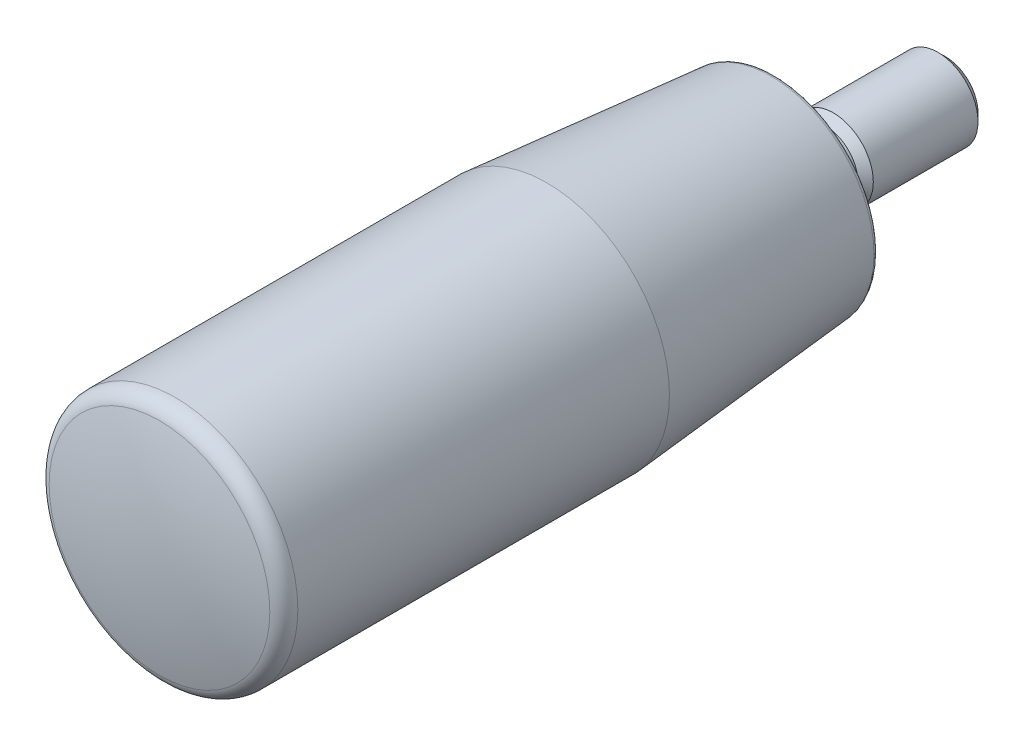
ISO-10303-21;
HEADER;
FILE_DESCRIPTION(('STEP AP214'),'2;1');
FILE_NAME('part.step','',(''),(''),'','','');
FILE_SCHEMA(('AUTOMOTIVE_DESIGN { 1 0 10303 214 1 1 1 1 }'));
ENDSEC;
DATA;
#1=APPLICATION_CONTEXT('core data for automotive mechanical design processes');
#2=APPLICATION_PROTOCOL_DEFINITION('international standard','automotive_design',2000,#1);
#3=PRODUCT_CONTEXT('',#1,'mechanical');
#4=PRODUCT('Part','Part','',(#3));
#5=PRODUCT_RELATED_PRODUCT_CATEGORY('part','',(#4));
#6=PRODUCT_DEFINITION_FORMATION('','',#4);
#7=PRODUCT_DEFINITION_CONTEXT('part definition',#1,'design');
#8=PRODUCT_DEFINITION('design','',#6,#7);
#9=PRODUCT_DEFINITION_SHAPE('','',#8);
#10=(LENGTH_UNIT() NAMED_UNIT(*) SI_UNIT(.MILLI.,.METRE.));
#11=(NAMED_UNIT(*) PLANE_ANGLE_UNIT() SI_UNIT($,.RADIAN.));
#12=(NAMED_UNIT(*) SI_UNIT($,.STERADIAN.) SOLID_ANGLE_UNIT());
#13=UNCERTAINTY_MEASURE_WITH_UNIT(LENGTH_MEASURE(1.E-05),#10,'distance_accuracy_value','');
#14=(GEOMETRIC_REPRESENTATION_CONTEXT(3) GLOBAL_UNCERTAINTY_ASSIGNED_CONTEXT((#13)) GLOBAL_UNIT_ASSIGNED_CONTEXT((#10,
#11,#12)) REPRESENTATION_CONTEXT('',''));
#15=CARTESIAN_POINT('',(0.,0.,0.));
#16=DIRECTION('',(0.,0.,1.));
#17=DIRECTION('',(1.,0.,0.));
#18=AXIS2_PLACEMENT_3D('',#15,#16,#17);
#19=CARTESIAN_POINT('',(0.,0.,-15.));
#20=DIRECTION('',(0.,0.,1.));
#21=DIRECTION('',(1.,0.,0.));
#22=AXIS2_PLACEMENT_3D('',#19,#20,#21);
#23=PLANE('',#22);
#24=CARTESIAN_POINT('',(0.,0.,-15.));
#25=DIRECTION('',(0.,0.,1.));
#26=DIRECTION('',(1.,0.,0.));
#27=AXIS2_PLACEMENT_3D('',#24,#25,#26);
#28=CIRCLE('',#27,3.233);
#29=CARTESIAN_POINT('',(3.233,0.,-15.));
#30=VERTEX_POINT('',#29);
#31=EDGE_CURVE('E130',#30,#30,#28,.T.);
#32=ORIENTED_EDGE('',*,*,#31,.F.);
#33=EDGE_LOOP('',(#32));
#34=FACE_BOUND('',#33,.T.);
#35=DIRECTION('',(-0.866025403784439,-0.5,0.));
#36=VECTOR('',#35,1.);
#37=CARTESIAN_POINT('',(1.,-1.73205080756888,-15.));
#38=LINE('',#37,#36);
#39=CARTESIAN_POINT('',(2.,-1.15470053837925,-15.));
#40=VERTEX_POINT('',#39);
#41=CARTESIAN_POINT('',(0.,-2.30940107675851,-15.));
#42=VERTEX_POINT('',#41);
#43=EDGE_CURVE('E9',#40,#42,#38,.T.);
#44=ORIENTED_EDGE('',*,*,#43,.F.);
#45=DIRECTION('',(0.,-1.,0.));
#46=VECTOR('',#45,1.);
#47=CARTESIAN_POINT('',(2.,0.,-15.));
#48=LINE('',#47,#46);
#49=CARTESIAN_POINT('',(2.,1.15470053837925,-15.));
#50=VERTEX_POINT('',#49);
#51=EDGE_CURVE('E78',#50,#40,#48,.T.);
#52=ORIENTED_EDGE('',*,*,#51,.F.);
#53=DIRECTION('',(0.866025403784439,-0.5,0.));
#54=VECTOR('',#53,1.);
#55=CARTESIAN_POINT('',(1.,1.73205080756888,-15.));
#56=LINE('',#55,#54);
#57=CARTESIAN_POINT('',(0.,2.30940107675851,-15.));
#58=VERTEX_POINT('',#57);
#59=EDGE_CURVE('E134',#58,#50,#56,.T.);
#60=ORIENTED_EDGE('',*,*,#59,.F.);
#61=DIRECTION('',(0.866025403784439,0.5,0.));
#62=VECTOR('',#61,1.);
#63=CARTESIAN_POINT('',(-1.,1.73205080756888,-15.));
#64=LINE('',#63,#62);
#65=CARTESIAN_POINT('',(-2.,1.15470053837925,-15.));
#66=VERTEX_POINT('',#65);
#67=EDGE_CURVE('E136',#66,#58,#64,.T.);
#68=ORIENTED_EDGE('',*,*,#67,.F.);
#69=DIRECTION('',(0.,1.,0.));
#70=VECTOR('',#69,1.);
#71=CARTESIAN_POINT('',(-2.,0.,-15.));
#72=LINE('',#71,#70);
#73=CARTESIAN_POINT('',(-2.,-1.15470053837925,-15.));
#74=VERTEX_POINT('',#73);
#75=EDGE_CURVE('E138',#74,#66,#72,.T.);
#76=ORIENTED_EDGE('',*,*,#75,.F.);
#77=DIRECTION('',(-0.866025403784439,0.5,0.));
#78=VECTOR('',#77,1.);
#79=CARTESIAN_POINT('',(-1.,-1.73205080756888,-15.));
#80=LINE('',#79,#78);
#81=EDGE_CURVE('E21',#42,#74,#80,.T.);
#82=ORIENTED_EDGE('',*,*,#81,.F.);
#83=EDGE_LOOP('',(#44,#52,#60,#68,#76,#82));
#84=FACE_BOUND('',#83,.T.);
#85=ADVANCED_FACE('F14',(#34,#84),#23,.F.);
#86=CARTESIAN_POINT('',(0.,0.,-15.));
#87=DIRECTION('',(0.,0.,1.));
#88=DIRECTION('',(1.,0.,0.));
#89=AXIS2_PLACEMENT_3D('',#86,#87,#88);
#90=CONICAL_SURFACE('',#89,3.233,0.785398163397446);
#91=CARTESIAN_POINT('',(0.,0.,-14.233));
#92=DIRECTION('',(0.,0.,1.));
#93=DIRECTION('',(1.,0.,0.));
#94=AXIS2_PLACEMENT_3D('',#91,#92,#93);
#95=CIRCLE('',#94,4.);
#96=CARTESIAN_POINT('',(4.,0.,-14.233));
#97=VERTEX_POINT('',#96);
#98=EDGE_CURVE('E127',#97,#97,#95,.T.);
#99=ORIENTED_EDGE('',*,*,#98,.F.);
#100=EDGE_LOOP('',(#99));
#101=FACE_BOUND('',#100,.T.);
#102=ORIENTED_EDGE('',*,*,#31,.T.);
#103=EDGE_LOOP('',(#102));
#104=FACE_BOUND('',#103,.T.);
#105=ADVANCED_FACE('F171',(#101,#104),#90,.T.);
#106=CARTESIAN_POINT('',(0.,0.,65.));
#107=DIRECTION('',(0.,0.,1.));
#108=DIRECTION('',(1.,0.,0.));
#109=AXIS2_PLACEMENT_3D('',#106,#107,#108);
#110=CYLINDRICAL_SURFACE('',#109,4.);
#111=CARTESIAN_POINT('',(0.,0.,-3.767));
#112=DIRECTION('',(0.,0.,1.));
#113=DIRECTION('',(1.,0.,0.));
#114=AXIS2_PLACEMENT_3D('',#111,#112,#113);
#115=CIRCLE('',#114,4.);
#116=CARTESIAN_POINT('',(4.,0.,-3.767));
#117=VERTEX_POINT('',#116);
#118=EDGE_CURVE('E124',#117,#117,#115,.T.);
#119=ORIENTED_EDGE('',*,*,#118,.F.);
#120=EDGE_LOOP('',(#119));
#121=FACE_BOUND('',#120,.T.);
#122=ORIENTED_EDGE('',*,*,#98,.T.);
#123=EDGE_LOOP('',(#122));
#124=FACE_BOUND('',#123,.T.);
#125=ADVANCED_FACE('F176',(#121,#124),#110,.T.);
#126=CARTESIAN_POINT('',(0.,0.,-3.767));
#127=DIRECTION('',(0.,0.,-1.));
#128=DIRECTION('',(-1.,0.,0.));
#129=AXIS2_PLACEMENT_3D('',#126,#127,#128);
#130=CONICAL_SURFACE('',#129,4.,0.785398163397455);
#131=CARTESIAN_POINT('',(0.,0.,-3.));
#132=DIRECTION('',(0.,0.,1.));
#133=DIRECTION('',(1.,0.,0.));
#134=AXIS2_PLACEMENT_3D('',#131,#132,#133);
#135=CIRCLE('',#134,3.233);
#136=CARTESIAN_POINT('',(3.233,0.,-3.));
#137=VERTEX_POINT('',#136);
#138=EDGE_CURVE('E121',#137,#137,#135,.T.);
#139=ORIENTED_EDGE('',*,*,#138,.F.);
#140=EDGE_LOOP('',(#139));
#141=FACE_BOUND('',#140,.T.);
#142=ORIENTED_EDGE('',*,*,#118,.T.);
#143=EDGE_LOOP('',(#142));
#144=FACE_BOUND('',#143,.T.);
#145=ADVANCED_FACE('F183',(#141,#144),#130,.T.);
#146=CARTESIAN_POINT('',(0.,0.,65.));
#147=DIRECTION('',(0.,0.,1.));
#148=DIRECTION('',(1.,0.,0.));
#149=AXIS2_PLACEMENT_3D('',#146,#147,#148);
#150=CYLINDRICAL_SURFACE('',#149,3.233);
#151=CARTESIAN_POINT('',(0.,0.,0.));
#152=DIRECTION('',(0.,0.,1.));
#153=DIRECTION('',(1.,0.,0.));
#154=AXIS2_PLACEMENT_3D('',#151,#152,#153);
#155=CIRCLE('',#154,3.233);
#156=CARTESIAN_POINT('',(3.233,0.,0.));
#157=VERTEX_POINT('',#156);
#158=EDGE_CURVE('E118',#157,#157,#155,.T.);
#159=ORIENTED_EDGE('',*,*,#158,.F.);
#160=EDGE_LOOP('',(#159));
#161=FACE_BOUND('',#160,.T.);
#162=ORIENTED_EDGE('',*,*,#138,.T.);
#163=EDGE_LOOP('',(#162));
#164=FACE_BOUND('',#163,.T.);
#165=ADVANCED_FACE('F190',(#161,#164),#150,.T.);
#166=CARTESIAN_POINT('',(0.,3.233,0.));
#167=DIRECTION('',(0.,0.,1.));
#168=DIRECTION('',(1.,0.,0.));
#169=AXIS2_PLACEMENT_3D('',#166,#167,#168);
#170=PLANE('',#169);
#171=CARTESIAN_POINT('',(0.,0.,0.));
#172=DIRECTION('',(0.,0.,1.));
#173=DIRECTION('',(1.,0.,0.));
#174=AXIS2_PLACEMENT_3D('',#171,#172,#173);
#175=CIRCLE('',#174,5.);
#176=CARTESIAN_POINT('',(5.,0.,0.));
#177=VERTEX_POINT('',#176);
#178=EDGE_CURVE('E115',#177,#177,#175,.T.);
#179=ORIENTED_EDGE('',*,*,#178,.F.);
#180=EDGE_LOOP('',(#179));
#181=FACE_BOUND('',#180,.T.);
#182=ORIENTED_EDGE('',*,*,#158,.T.);
#183=EDGE_LOOP('',(#182));
#184=FACE_BOUND('',#183,.T.);
#185=ADVANCED_FACE('F194',(#181,#184),#170,.F.);
#186=CARTESIAN_POINT('',(0.,0.,65.));
#187=DIRECTION('',(0.,0.,1.));
#188=DIRECTION('',(1.,0.,0.));
#189=AXIS2_PLACEMENT_3D('',#186,#187,#188);
#190=CYLINDRICAL_SURFACE('',#189,5.);
#191=CARTESIAN_POINT('',(0.,0.,2.));
#192=DIRECTION('',(0.,0.,1.));
#193=DIRECTION('',(1.,0.,0.));
#194=AXIS2_PLACEMENT_3D('',#191,#192,#193);
#195=CIRCLE('',#194,5.);
#196=CARTESIAN_POINT('',(5.,0.,2.));
#197=VERTEX_POINT('',#196);
#198=EDGE_CURVE('E112',#197,#197,#195,.T.);
#199=ORIENTED_EDGE('',*,*,#198,.F.);
#200=EDGE_LOOP('',(#199));
#201=FACE_BOUND('',#200,.T.);
#202=ORIENTED_EDGE('',*,*,#178,.T.);
#203=EDGE_LOOP('',(#202));
#204=FACE_BOUND('',#203,.T.);
#205=ADVANCED_FACE('F198',(#201,#204),#190,.T.);
#206=CARTESIAN_POINT('',(0.,5.,2.));
#207=DIRECTION('',(0.,0.,1.));
#208=DIRECTION('',(1.,0.,0.));
#209=AXIS2_PLACEMENT_3D('',#206,#207,#208);
#210=PLANE('',#209);
#211=CARTESIAN_POINT('',(0.,0.,2.));
#212=DIRECTION('',(0.,0.,1.));
#213=DIRECTION('',(1.,0.,0.));
#214=AXIS2_PLACEMENT_3D('',#211,#212,#213);
#215=CIRCLE('',#214,9.79183441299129);
#216=CARTESIAN_POINT('',(9.79183441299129,0.,2.));
#217=VERTEX_POINT('',#216);
#218=EDGE_CURVE('E109',#217,#217,#215,.T.);
#219=ORIENTED_EDGE('',*,*,#218,.F.);
#220=EDGE_LOOP('',(#219));
#221=FACE_BOUND('',#220,.T.);
#222=ORIENTED_EDGE('',*,*,#198,.T.);
#223=EDGE_LOOP('',(#222));
#224=FACE_BOUND('',#223,.T.);
#225=ADVANCED_FACE('F202',(#221,#224),#210,.F.);
#226=CARTESIAN_POINT('',(0.,0.,2.5));
#227=DIRECTION('',(0.,0.,1.));
#228=DIRECTION('',(1.,0.,0.));
#229=AXIS2_PLACEMENT_3D('',#226,#227,#228);
#230=TOROIDAL_SURFACE('',#229,9.79183441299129,0.499999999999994);
#231=ORIENTED_EDGE('',*,*,#218,.T.);
#232=EDGE_LOOP('',(#231));
#233=FACE_BOUND('',#232,.T.);
#234=CARTESIAN_POINT('',(0.,0.,2.4564221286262));
#235=DIRECTION('',(0.,0.,1.));
#236=DIRECTION('',(1.,0.,0.));
#237=AXIS2_PLACEMENT_3D('',#234,#235,#236);
#238=CIRCLE('',#237,10.2899317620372);
#239=CARTESIAN_POINT('',(10.2899317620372,0.,2.4564221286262));
#240=VERTEX_POINT('',#239);
#241=EDGE_CURVE('E106',#240,#240,#238,.T.);
#242=ORIENTED_EDGE('',*,*,#241,.F.);
#243=EDGE_LOOP('',(#242));
#244=FACE_BOUND('',#243,.T.);
#245=ADVANCED_FACE('F206',(#233,#244),#230,.T.);
#246=CARTESIAN_POINT('',(0.,0.,2.4564221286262));
#247=DIRECTION('',(0.,0.,1.));
#248=DIRECTION('',(1.,0.,0.));
#249=AXIS2_PLACEMENT_3D('',#246,#247,#248);
#250=CONICAL_SURFACE('',#249,10.2899317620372,0.0872664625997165);
#251=CARTESIAN_POINT('',(0.,0.,24.8601046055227));
#252=DIRECTION('',(0.,0.,1.));
#253=DIRECTION('',(1.,0.,0.));
#254=AXIS2_PLACEMENT_3D('',#251,#252,#253);
#255=CIRCLE('',#254,12.25);
#256=CARTESIAN_POINT('',(12.25,0.,24.8601046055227));
#257=VERTEX_POINT('',#256);
#258=EDGE_CURVE('E103',#257,#257,#255,.T.);
#259=ORIENTED_EDGE('',*,*,#258,.F.);
#260=EDGE_LOOP('',(#259));
#261=FACE_BOUND('',#260,.T.);
#262=ORIENTED_EDGE('',*,*,#241,.T.);
#263=EDGE_LOOP('',(#262));
#264=FACE_BOUND('',#263,.T.);
#265=ADVANCED_FACE('F210',(#261,#264),#250,.T.);
#266=CARTESIAN_POINT('',(0.,0.,65.));
#267=DIRECTION('',(0.,0.,1.));
#268=DIRECTION('',(1.,0.,0.));
#269=AXIS2_PLACEMENT_3D('',#266,#267,#268);
#270=CYLINDRICAL_SURFACE('',#269,12.25);
#271=CARTESIAN_POINT('',(0.,0.,62.006594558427));
#272=DIRECTION('',(0.,0.,1.));
#273=DIRECTION('',(1.,0.,0.));
#274=AXIS2_PLACEMENT_3D('',#271,#272,#273);
#275=CIRCLE('',#274,12.25);
#276=CARTESIAN_POINT('',(12.25,0.,62.006594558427));
#277=VERTEX_POINT('',#276);
#278=EDGE_CURVE('E100',#277,#277,#275,.T.);
#279=ORIENTED_EDGE('',*,*,#278,.F.);
#280=EDGE_LOOP('',(#279));
#281=FACE_BOUND('',#280,.T.);
#282=ORIENTED_EDGE('',*,*,#258,.T.);
#283=EDGE_LOOP('',(#282));
#284=FACE_BOUND('',#283,.T.);
#285=ADVANCED_FACE('F214',(#281,#284),#270,.T.);
#286=CARTESIAN_POINT('',(0.,0.,62.006594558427));
#287=DIRECTION('',(0.,0.,1.));
#288=DIRECTION('',(1.,0.,0.));
#289=AXIS2_PLACEMENT_3D('',#286,#287,#288);
#290=TOROIDAL_SURFACE('',#289,10.6166666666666,1.63333333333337);
#291=ORIENTED_EDGE('',*,*,#278,.T.);
#292=EDGE_LOOP('',(#291));
#293=FACE_BOUND('',#292,.T.);
#294=CARTESIAN_POINT('',(0.,0.,63.5871827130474));
#295=DIRECTION('',(0.,0.,1.));
#296=DIRECTION('',(1.,0.,0.));
#297=AXIS2_PLACEMENT_3D('',#294,#295,#296);
#298=CIRCLE('',#297,11.0283933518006);
#299=CARTESIAN_POINT('',(11.0283933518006,0.,63.5871827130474));
#300=VERTEX_POINT('',#299);
#301=EDGE_CURVE('E97',#300,#300,#298,.T.);
#302=ORIENTED_EDGE('',*,*,#301,.F.);
#303=EDGE_LOOP('',(#302));
#304=FACE_BOUND('',#303,.T.);
#305=ADVANCED_FACE('F218',(#293,#304),#290,.T.);
#306=CARTESIAN_POINT('',(0.,1.3010426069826E-13,21.2500000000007));
#307=DIRECTION('',(0.,0.,1.));
#308=DIRECTION('',(0.,-1.,0.));
#309=AXIS2_PLACEMENT_3D('',#306,#307,#308);
#310=SPHERICAL_SURFACE('',#309,43.7499999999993);
#311=ORIENTED_EDGE('',*,*,#301,.T.);
#312=EDGE_LOOP('',(#311));
#313=FACE_BOUND('',#312,.T.);
#314=ADVANCED_FACE('F222',(#313),#310,.T.);
#315=CARTESIAN_POINT('',(2.,-1.15470053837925,-19.));
#316=DIRECTION('',(-0.5,0.866025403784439,0.));
#317=DIRECTION('',(-0.866025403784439,-0.5,0.));
#318=AXIS2_PLACEMENT_3D('',#315,#316,#317);
#319=PLANE('',#318);
#320=ORIENTED_EDGE('',*,*,#43,.T.);
#321=DIRECTION('',(0.,0.,1.));
#322=VECTOR('',#321,1.);
#323=CARTESIAN_POINT('',(0.,-2.30940107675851,-19.));
#324=LINE('',#323,#322);
#325=CARTESIAN_POINT('',(0.,-2.30940107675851,-11.));
#326=VERTEX_POINT('',#325);
#327=EDGE_CURVE('E67',#42,#326,#324,.T.);
#328=ORIENTED_EDGE('',*,*,#327,.T.);
#329=DIRECTION('',(-0.866025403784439,-0.5,0.));
#330=VECTOR('',#329,1.);
#331=CARTESIAN_POINT('',(2.,-1.15470053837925,-11.));
#332=LINE('',#331,#330);
#333=CARTESIAN_POINT('',(2.,-1.15470053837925,-11.));
#334=VERTEX_POINT('',#333);
#335=EDGE_CURVE('E63',#334,#326,#332,.T.);
#336=ORIENTED_EDGE('',*,*,#335,.F.);
#337=DIRECTION('',(0.,0.,1.));
#338=VECTOR('',#337,1.);
#339=CARTESIAN_POINT('',(2.,-1.15470053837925,-19.));
#340=LINE('',#339,#338);
#341=EDGE_CURVE('E66',#40,#334,#340,.T.);
#342=ORIENTED_EDGE('',*,*,#341,.F.);
#343=EDGE_LOOP('',(#320,#328,#336,#342));
#344=FACE_BOUND('',#343,.T.);
#345=ADVANCED_FACE('F65',(#344),#319,.T.);
#346=CARTESIAN_POINT('',(0.,-2.30940107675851,-19.));
#347=DIRECTION('',(0.5,0.866025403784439,0.));
#348=DIRECTION('',(-0.866025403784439,0.5,0.));
#349=AXIS2_PLACEMENT_3D('',#346,#347,#348);
#350=PLANE('',#349);
#351=ORIENTED_EDGE('',*,*,#81,.T.);
#352=DIRECTION('',(0.,0.,1.));
#353=VECTOR('',#352,1.);
#354=CARTESIAN_POINT('',(-2.,-1.15470053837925,-19.));
#355=LINE('',#354,#353);
#356=CARTESIAN_POINT('',(-2.,-1.15470053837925,-11.));
#357=VERTEX_POINT('',#356);
#358=EDGE_CURVE('E94',#74,#357,#355,.T.);
#359=ORIENTED_EDGE('',*,*,#358,.T.);
#360=DIRECTION('',(-0.866025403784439,0.5,0.));
#361=VECTOR('',#360,1.);
#362=CARTESIAN_POINT('',(0.,-2.30940107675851,-11.));
#363=LINE('',#362,#361);
#364=EDGE_CURVE('E72',#326,#357,#363,.T.);
#365=ORIENTED_EDGE('',*,*,#364,.F.);
#366=ORIENTED_EDGE('',*,*,#327,.F.);
#367=EDGE_LOOP('',(#351,#359,#365,#366));
#368=FACE_BOUND('',#367,.T.);
#369=ADVANCED_FACE('F142',(#368),#350,.T.);
#370=CARTESIAN_POINT('',(-2.,-1.15470053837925,-19.));
#371=DIRECTION('',(1.,0.,0.));
#372=DIRECTION('',(0.,1.,0.));
#373=AXIS2_PLACEMENT_3D('',#370,#371,#372);
#374=PLANE('',#373);
#375=ORIENTED_EDGE('',*,*,#75,.T.);
#376=DIRECTION('',(0.,0.,1.));
#377=VECTOR('',#376,1.);
#378=CARTESIAN_POINT('',(-2.,1.15470053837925,-19.));
#379=LINE('',#378,#377);
#380=CARTESIAN_POINT('',(-2.,1.15470053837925,-11.));
#381=VERTEX_POINT('',#380);
#382=EDGE_CURVE('E92',#66,#381,#379,.T.);
#383=ORIENTED_EDGE('',*,*,#382,.T.);
#384=DIRECTION('',(0.,1.,0.));
#385=VECTOR('',#384,1.);
#386=CARTESIAN_POINT('',(-2.,-1.15470053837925,-11.));
#387=LINE('',#386,#385);
#388=EDGE_CURVE('E150',#357,#381,#387,.T.);
#389=ORIENTED_EDGE('',*,*,#388,.F.);
#390=ORIENTED_EDGE('',*,*,#358,.F.);
#391=EDGE_LOOP('',(#375,#383,#389,#390));
#392=FACE_BOUND('',#391,.T.);
#393=ADVANCED_FACE('F147',(#392),#374,.T.);
#394=CARTESIAN_POINT('',(-2.,1.15470053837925,-19.));
#395=DIRECTION('',(0.5,-0.866025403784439,0.));
#396=DIRECTION('',(0.866025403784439,0.5,0.));
#397=AXIS2_PLACEMENT_3D('',#394,#395,#396);
#398=PLANE('',#397);
#399=ORIENTED_EDGE('',*,*,#67,.T.);
#400=DIRECTION('',(0.,0.,1.));
#401=VECTOR('',#400,1.);
#402=CARTESIAN_POINT('',(0.,2.30940107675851,-19.));
#403=LINE('',#402,#401);
#404=CARTESIAN_POINT('',(0.,2.30940107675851,-11.));
#405=VERTEX_POINT('',#404);
#406=EDGE_CURVE('E90',#58,#405,#403,.T.);
#407=ORIENTED_EDGE('',*,*,#406,.T.);
#408=DIRECTION('',(0.866025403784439,0.5,0.));
#409=VECTOR('',#408,1.);
#410=CARTESIAN_POINT('',(-2.,1.15470053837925,-11.));
#411=LINE('',#410,#409);
#412=EDGE_CURVE('E85',#381,#405,#411,.T.);
#413=ORIENTED_EDGE('',*,*,#412,.F.);
#414=ORIENTED_EDGE('',*,*,#382,.F.);
#415=EDGE_LOOP('',(#399,#407,#413,#414));
#416=FACE_BOUND('',#415,.T.);
#417=ADVANCED_FACE('F155',(#416),#398,.T.);
#418=CARTESIAN_POINT('',(0.,2.30940107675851,-19.));
#419=DIRECTION('',(-0.5,-0.866025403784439,0.));
#420=DIRECTION('',(0.866025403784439,-0.5,0.));
#421=AXIS2_PLACEMENT_3D('',#418,#419,#420);
#422=PLANE('',#421);
#423=ORIENTED_EDGE('',*,*,#59,.T.);
#424=DIRECTION('',(0.,0.,1.));
#425=VECTOR('',#424,1.);
#426=CARTESIAN_POINT('',(2.,1.15470053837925,-19.));
#427=LINE('',#426,#425);
#428=CARTESIAN_POINT('',(2.,1.15470053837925,-11.));
#429=VERTEX_POINT('',#428);
#430=EDGE_CURVE('E28',#50,#429,#427,.T.);
#431=ORIENTED_EDGE('',*,*,#430,.T.);
#432=DIRECTION('',(0.866025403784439,-0.5,0.));
#433=VECTOR('',#432,1.);
#434=CARTESIAN_POINT('',(0.,2.30940107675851,-11.));
#435=LINE('',#434,#433);
#436=EDGE_CURVE('E83',#405,#429,#435,.T.);
#437=ORIENTED_EDGE('',*,*,#436,.F.);
#438=ORIENTED_EDGE('',*,*,#406,.F.);
#439=EDGE_LOOP('',(#423,#431,#437,#438));
#440=FACE_BOUND('',#439,.T.);
#441=ADVANCED_FACE('F158',(#440),#422,.T.);
#442=CARTESIAN_POINT('',(2.,1.15470053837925,-19.));
#443=DIRECTION('',(-1.,0.,0.));
#444=DIRECTION('',(0.,-1.,0.));
#445=AXIS2_PLACEMENT_3D('',#442,#443,#444);
#446=PLANE('',#445);
#447=ORIENTED_EDGE('',*,*,#51,.T.);
#448=ORIENTED_EDGE('',*,*,#341,.T.);
#449=DIRECTION('',(0.,-1.,0.));
#450=VECTOR('',#449,1.);
#451=CARTESIAN_POINT('',(2.,1.15470053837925,-11.));
#452=LINE('',#451,#450);
#453=EDGE_CURVE('E75',#429,#334,#452,.T.);
#454=ORIENTED_EDGE('',*,*,#453,.F.);
#455=ORIENTED_EDGE('',*,*,#430,.F.);
#456=EDGE_LOOP('',(#447,#448,#454,#455));
#457=FACE_BOUND('',#456,.T.);
#458=ADVANCED_FACE('F74',(#457),#446,.T.);
#459=CARTESIAN_POINT('',(0.,0.,-11.));
#460=DIRECTION('',(0.,0.,-1.));
#461=DIRECTION('',(-1.,0.,0.));
#462=AXIS2_PLACEMENT_3D('',#459,#460,#461);
#463=PLANE('',#462);
#464=ORIENTED_EDGE('',*,*,#453,.T.);
#465=ORIENTED_EDGE('',*,*,#335,.T.);
#466=ORIENTED_EDGE('',*,*,#364,.T.);
#467=ORIENTED_EDGE('',*,*,#388,.T.);
#468=ORIENTED_EDGE('',*,*,#412,.T.);
#469=ORIENTED_EDGE('',*,*,#436,.T.);
#470=EDGE_LOOP('',(#464,#465,#466,#467,#468,#469));
#471=FACE_BOUND('',#470,.T.);
#472=ADVANCED_FACE('F80',(#471),#463,.T.);
#473=CLOSED_SHELL('',(#85,#105,#125,#145,#165,#185,#205,#225,#245,#265,#285,#305,#314,#345,#369,
#393,#417,#441,#458,#472));
#474=MANIFOLD_SOLID_BREP('B1',#473);
#475=ADVANCED_BREP_SHAPE_REPRESENTATION('',(#18,#474),#14);
#476=SHAPE_DEFINITION_REPRESENTATION(#9,#475);
ENDSEC;
END-ISO-10303-21;
